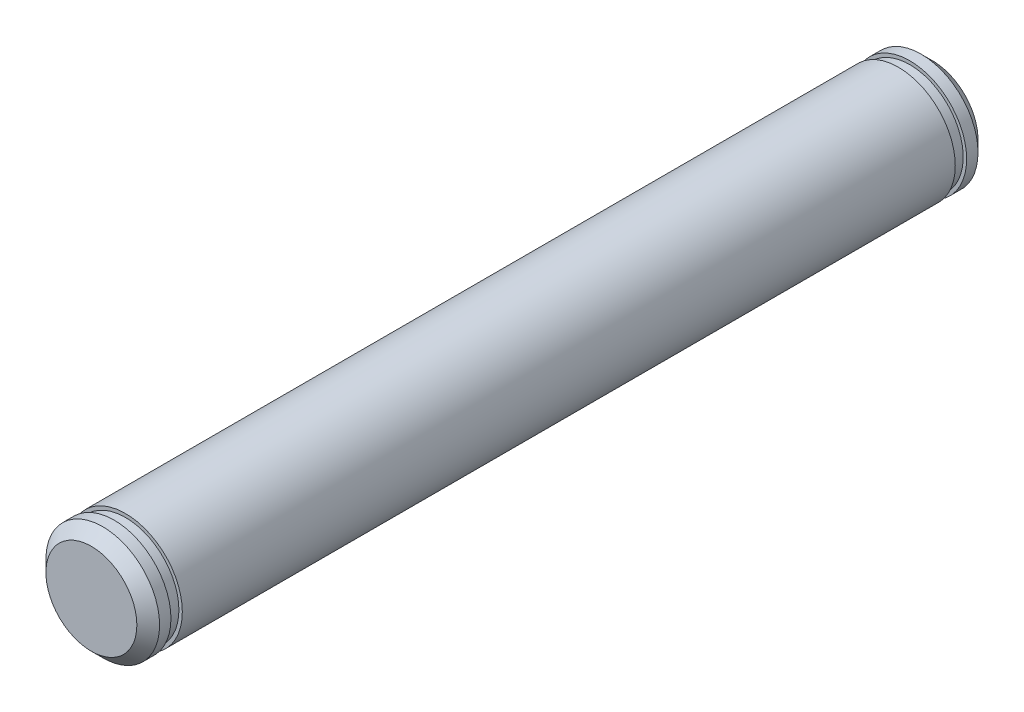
from build123d import *

# Parameters (mm, degrees)
ESQUISSE1_R                  = 5
EXTRUSION1_DEPTH             = 34
ESQUISSE2_R                  = 4.7
EXTRUSION2_DEPTH             = 1
ESQUISSE3_R                  = 5
EXTRUSION3_DEPTH             = 2
CHANFREIN1_SIZE              = 1
CHANFREIN1_OF_SYM_TRIE1_SIZE = 1


with BuildPart() as part:
    # Esquisse1 → Extrusion1 (new body)
    with BuildSketch(Plane.XY):
        Circle(ESQUISSE1_R)
    extrusion1 = extrude(amount=EXTRUSION1_DEPTH)

    # Esquisse2 → Extrusion2 (add)
    with BuildSketch(Plane.XY.offset(34)):
        Circle(ESQUISSE2_R)
    extrusion2 = extrude(amount=EXTRUSION2_DEPTH)

    # Esquisse3 → Extrusion3 (add)
    with BuildSketch(Plane.XY.offset(35)):
        Circle(ESQUISSE3_R)
    extrusion3 = extrude(amount=EXTRUSION3_DEPTH)

    # Chanfrein1
    chanfrein1_edges = [part.edges().sort_by_distance(p)[0] for p in [
        (-5, 0, 37),
    ]]
    chamfer(chanfrein1_edges, length=CHANFREIN1_SIZE)

    # Sym_trie1: Extrusion1, Extrusion2, Extrusion3 across plane
    add(extrusion1.mirror(Plane.XY))
    add(extrusion2.mirror(Plane.XY))
    add(extrusion3.mirror(Plane.XY))

    # Chanfrein1 of Sym_trie1
    chanfrein1_of_sym_trie1_edges = [part.edges().sort_by_distance(p)[0] for p in [
        (-5, 0, -37),
    ]]
    chamfer(chanfrein1_of_sym_trie1_edges, length=CHANFREIN1_OF_SYM_TRIE1_SIZE)


solid = part.part
